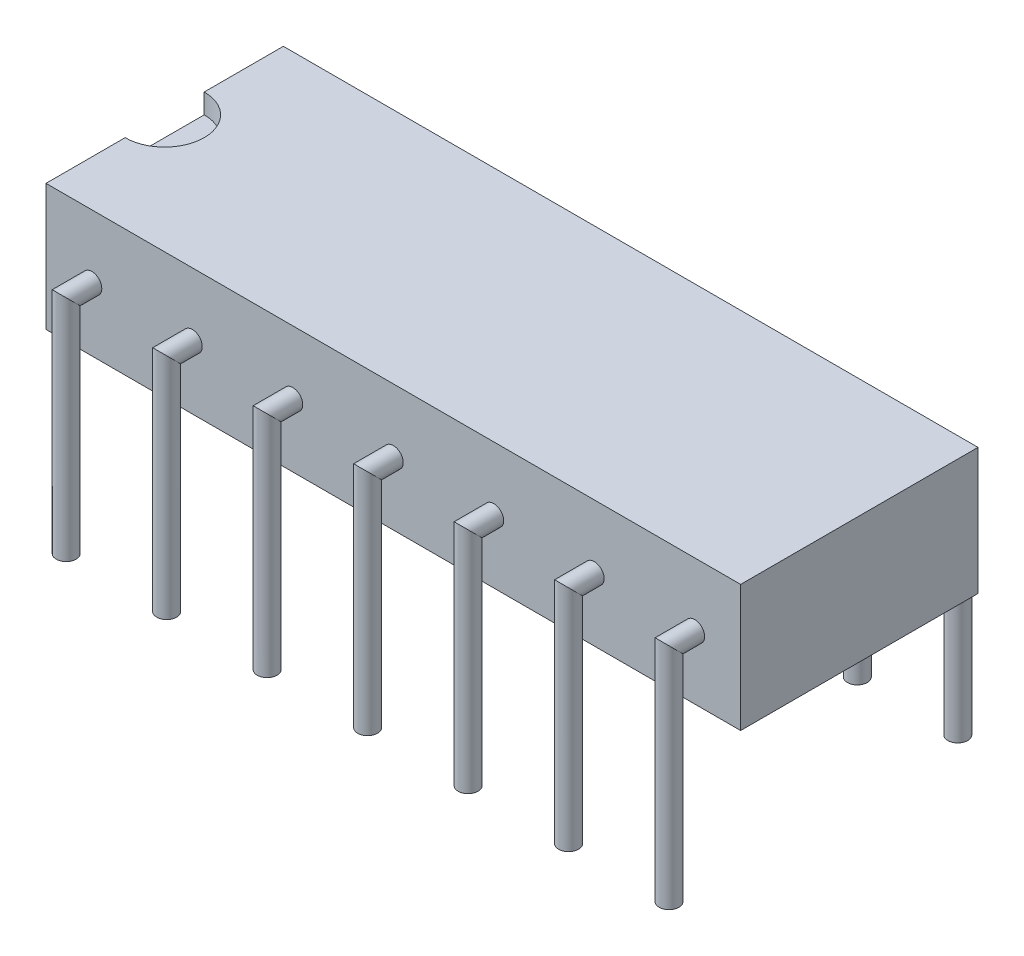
ISO-10303-21;
HEADER;
FILE_DESCRIPTION(('STEP AP214'),'2;1');
FILE_NAME('part.step','',(''),(''),'','','');
FILE_SCHEMA(('AUTOMOTIVE_DESIGN { 1 0 10303 214 1 1 1 1 }'));
ENDSEC;
DATA;
#1=APPLICATION_CONTEXT('core data for automotive mechanical design processes');
#2=APPLICATION_PROTOCOL_DEFINITION('international standard','automotive_design',2000,#1);
#3=PRODUCT_CONTEXT('',#1,'mechanical');
#4=PRODUCT('Part','Part','',(#3));
#5=PRODUCT_RELATED_PRODUCT_CATEGORY('part','',(#4));
#6=PRODUCT_DEFINITION_FORMATION('','',#4);
#7=PRODUCT_DEFINITION_CONTEXT('part definition',#1,'design');
#8=PRODUCT_DEFINITION('design','',#6,#7);
#9=PRODUCT_DEFINITION_SHAPE('','',#8);
#10=(LENGTH_UNIT() NAMED_UNIT(*) SI_UNIT(.MILLI.,.METRE.));
#11=(NAMED_UNIT(*) PLANE_ANGLE_UNIT() SI_UNIT($,.RADIAN.));
#12=(NAMED_UNIT(*) SI_UNIT($,.STERADIAN.) SOLID_ANGLE_UNIT());
#13=UNCERTAINTY_MEASURE_WITH_UNIT(LENGTH_MEASURE(1.E-05),#10,'distance_accuracy_value','');
#14=(GEOMETRIC_REPRESENTATION_CONTEXT(3) GLOBAL_UNCERTAINTY_ASSIGNED_CONTEXT((#13)) GLOBAL_UNIT_ASSIGNED_CONTEXT((#10,
#11,#12)) REPRESENTATION_CONTEXT('',''));
#15=CARTESIAN_POINT('',(0.,0.,0.));
#16=DIRECTION('',(0.,0.,1.));
#17=DIRECTION('',(1.,0.,0.));
#18=AXIS2_PLACEMENT_3D('',#15,#16,#17);
#19=CARTESIAN_POINT('',(17.56,3.2,3.));
#20=DIRECTION('',(0.,0.,-1.));
#21=DIRECTION('',(-1.,0.,0.));
#22=AXIS2_PLACEMENT_3D('',#19,#20,#21);
#23=PLANE('',#22);
#24=CARTESIAN_POINT('',(13.86,1.6,3.));
#25=DIRECTION('',(0.,0.,-1.));
#26=DIRECTION('',(-1.,0.,0.));
#27=AXIS2_PLACEMENT_3D('',#24,#25,#26);
#28=CIRCLE('',#27,0.25);
#29=CARTESIAN_POINT('',(13.61,1.6,3.));
#30=VERTEX_POINT('',#29);
#31=EDGE_CURVE('E55',#30,#30,#28,.F.);
#32=ORIENTED_EDGE('',*,*,#31,.F.);
#33=EDGE_LOOP('',(#32));
#34=FACE_BOUND('',#33,.T.);
#35=CARTESIAN_POINT('',(8.78,1.6,3.));
#36=DIRECTION('',(0.,0.,-1.));
#37=DIRECTION('',(-1.,0.,0.));
#38=AXIS2_PLACEMENT_3D('',#35,#36,#37);
#39=CIRCLE('',#38,0.25);
#40=CARTESIAN_POINT('',(8.53,1.6,3.));
#41=VERTEX_POINT('',#40);
#42=EDGE_CURVE('E155',#41,#41,#39,.F.);
#43=ORIENTED_EDGE('',*,*,#42,.F.);
#44=EDGE_LOOP('',(#43));
#45=FACE_BOUND('',#44,.T.);
#46=CARTESIAN_POINT('',(3.7,1.6,3.));
#47=DIRECTION('',(0.,0.,-1.));
#48=DIRECTION('',(-1.,0.,0.));
#49=AXIS2_PLACEMENT_3D('',#46,#47,#48);
#50=CIRCLE('',#49,0.25);
#51=CARTESIAN_POINT('',(3.45,1.6,3.));
#52=VERTEX_POINT('',#51);
#53=EDGE_CURVE('E149',#52,#52,#50,.F.);
#54=ORIENTED_EDGE('',*,*,#53,.F.);
#55=EDGE_LOOP('',(#54));
#56=FACE_BOUND('',#55,.T.);
#57=DIRECTION('',(0.,-1.,0.));
#58=VECTOR('',#57,1.);
#59=CARTESIAN_POINT('',(0.,3.2,3.));
#60=LINE('',#59,#58);
#61=CARTESIAN_POINT('',(0.,3.2,3.));
#62=VERTEX_POINT('',#61);
#63=CARTESIAN_POINT('',(0.,0.,3.));
#64=VERTEX_POINT('',#63);
#65=EDGE_CURVE('E177',#62,#64,#60,.T.);
#66=ORIENTED_EDGE('',*,*,#65,.T.);
#67=DIRECTION('',(-1.,0.,0.));
#68=VECTOR('',#67,1.);
#69=CARTESIAN_POINT('',(17.56,0.,3.));
#70=LINE('',#69,#68);
#71=CARTESIAN_POINT('',(17.56,0.,3.));
#72=VERTEX_POINT('',#71);
#73=EDGE_CURVE('E143',#72,#64,#70,.T.);
#74=ORIENTED_EDGE('',*,*,#73,.F.);
#75=DIRECTION('',(0.,-1.,0.));
#76=VECTOR('',#75,1.);
#77=CARTESIAN_POINT('',(17.56,3.2,3.));
#78=LINE('',#77,#76);
#79=CARTESIAN_POINT('',(17.56,3.2,3.));
#80=VERTEX_POINT('',#79);
#81=EDGE_CURVE('E123',#80,#72,#78,.T.);
#82=ORIENTED_EDGE('',*,*,#81,.F.);
#83=DIRECTION('',(-1.,0.,0.));
#84=VECTOR('',#83,1.);
#85=CARTESIAN_POINT('',(17.56,3.2,3.));
#86=LINE('',#85,#84);
#87=EDGE_CURVE('E136',#80,#62,#86,.T.);
#88=ORIENTED_EDGE('',*,*,#87,.T.);
#89=EDGE_LOOP('',(#66,#74,#82,#88));
#90=FACE_BOUND('',#89,.T.);
#91=CARTESIAN_POINT('',(1.16,1.6,3.));
#92=DIRECTION('',(0.,0.,-1.));
#93=DIRECTION('',(-1.,0.,0.));
#94=AXIS2_PLACEMENT_3D('',#91,#92,#93);
#95=CIRCLE('',#94,0.25);
#96=CARTESIAN_POINT('',(0.91,1.6,3.));
#97=VERTEX_POINT('',#96);
#98=EDGE_CURVE('E146',#97,#97,#95,.F.);
#99=ORIENTED_EDGE('',*,*,#98,.F.);
#100=EDGE_LOOP('',(#99));
#101=FACE_BOUND('',#100,.T.);
#102=CARTESIAN_POINT('',(6.24,1.6,3.));
#103=DIRECTION('',(0.,0.,-1.));
#104=DIRECTION('',(-1.,0.,0.));
#105=AXIS2_PLACEMENT_3D('',#102,#103,#104);
#106=CIRCLE('',#105,0.25);
#107=CARTESIAN_POINT('',(5.99,1.6,3.));
#108=VERTEX_POINT('',#107);
#109=EDGE_CURVE('E152',#108,#108,#106,.F.);
#110=ORIENTED_EDGE('',*,*,#109,.F.);
#111=EDGE_LOOP('',(#110));
#112=FACE_BOUND('',#111,.T.);
#113=CARTESIAN_POINT('',(11.32,1.6,3.));
#114=DIRECTION('',(0.,0.,-1.));
#115=DIRECTION('',(-1.,0.,0.));
#116=AXIS2_PLACEMENT_3D('',#113,#114,#115);
#117=CIRCLE('',#116,0.25);
#118=CARTESIAN_POINT('',(11.07,1.6,3.));
#119=VERTEX_POINT('',#118);
#120=EDGE_CURVE('E158',#119,#119,#117,.F.);
#121=ORIENTED_EDGE('',*,*,#120,.F.);
#122=EDGE_LOOP('',(#121));
#123=FACE_BOUND('',#122,.T.);
#124=CARTESIAN_POINT('',(16.4,1.6,3.));
#125=DIRECTION('',(0.,0.,-1.));
#126=DIRECTION('',(-1.,0.,0.));
#127=AXIS2_PLACEMENT_3D('',#124,#125,#126);
#128=CIRCLE('',#127,0.25);
#129=CARTESIAN_POINT('',(16.15,1.6,3.));
#130=VERTEX_POINT('',#129);
#131=EDGE_CURVE('E12',#130,#130,#128,.F.);
#132=ORIENTED_EDGE('',*,*,#131,.F.);
#133=EDGE_LOOP('',(#132));
#134=FACE_BOUND('',#133,.T.);
#135=ADVANCED_FACE('F48',(#34,#45,#56,#90,#101,#112,#123,#134),#23,.F.);
#136=CARTESIAN_POINT('',(17.56,0.,3.));
#137=DIRECTION('',(0.,1.,0.));
#138=DIRECTION('',(0.,0.,1.));
#139=AXIS2_PLACEMENT_3D('',#136,#137,#138);
#140=PLANE('',#139);
#141=DIRECTION('',(0.,0.,-1.));
#142=VECTOR('',#141,1.);
#143=CARTESIAN_POINT('',(0.,0.,3.));
#144=LINE('',#143,#142);
#145=CARTESIAN_POINT('',(0.,0.,-3.));
#146=VERTEX_POINT('',#145);
#147=EDGE_CURVE('E253',#64,#146,#144,.T.);
#148=ORIENTED_EDGE('',*,*,#147,.T.);
#149=DIRECTION('',(-1.,0.,0.));
#150=VECTOR('',#149,1.);
#151=CARTESIAN_POINT('',(17.56,0.,-3.));
#152=LINE('',#151,#150);
#153=CARTESIAN_POINT('',(17.56,0.,-3.));
#154=VERTEX_POINT('',#153);
#155=EDGE_CURVE('E140',#154,#146,#152,.T.);
#156=ORIENTED_EDGE('',*,*,#155,.F.);
#157=DIRECTION('',(0.,0.,-1.));
#158=VECTOR('',#157,1.);
#159=CARTESIAN_POINT('',(17.56,0.,3.));
#160=LINE('',#159,#158);
#161=EDGE_CURVE('E126',#72,#154,#160,.T.);
#162=ORIENTED_EDGE('',*,*,#161,.F.);
#163=ORIENTED_EDGE('',*,*,#73,.T.);
#164=EDGE_LOOP('',(#148,#156,#162,#163));
#165=FACE_BOUND('',#164,.T.);
#166=ADVANCED_FACE('F168',(#165),#140,.F.);
#167=CARTESIAN_POINT('',(17.56,3.2,-3.));
#168=DIRECTION('',(0.,0.,1.));
#169=DIRECTION('',(1.,0.,0.));
#170=AXIS2_PLACEMENT_3D('',#167,#168,#169);
#171=PLANE('',#170);
#172=CARTESIAN_POINT('',(16.4,1.6,-3.));
#173=DIRECTION('',(0.,0.,1.));
#174=DIRECTION('',(1.,0.,0.));
#175=AXIS2_PLACEMENT_3D('',#172,#173,#174);
#176=CIRCLE('',#175,0.25);
#177=CARTESIAN_POINT('',(16.65,1.6,-3.));
#178=VERTEX_POINT('',#177);
#179=EDGE_CURVE('E740',#178,#178,#176,.T.);
#180=ORIENTED_EDGE('',*,*,#179,.T.);
#181=EDGE_LOOP('',(#180));
#182=FACE_BOUND('',#181,.T.);
#183=CARTESIAN_POINT('',(13.86,1.6,-3.));
#184=DIRECTION('',(0.,0.,1.));
#185=DIRECTION('',(1.,0.,0.));
#186=AXIS2_PLACEMENT_3D('',#183,#184,#185);
#187=CIRCLE('',#186,0.25);
#188=CARTESIAN_POINT('',(14.11,1.6,-3.));
#189=VERTEX_POINT('',#188);
#190=EDGE_CURVE('E733',#189,#189,#187,.T.);
#191=ORIENTED_EDGE('',*,*,#190,.T.);
#192=EDGE_LOOP('',(#191));
#193=FACE_BOUND('',#192,.T.);
#194=CARTESIAN_POINT('',(11.32,1.6,-3.));
#195=DIRECTION('',(0.,0.,1.));
#196=DIRECTION('',(1.,0.,0.));
#197=AXIS2_PLACEMENT_3D('',#194,#195,#196);
#198=CIRCLE('',#197,0.25);
#199=CARTESIAN_POINT('',(11.57,1.6,-3.));
#200=VERTEX_POINT('',#199);
#201=EDGE_CURVE('E749',#200,#200,#198,.T.);
#202=ORIENTED_EDGE('',*,*,#201,.T.);
#203=EDGE_LOOP('',(#202));
#204=FACE_BOUND('',#203,.T.);
#205=CARTESIAN_POINT('',(8.78,1.6,-3.));
#206=DIRECTION('',(0.,0.,1.));
#207=DIRECTION('',(1.,0.,0.));
#208=AXIS2_PLACEMENT_3D('',#205,#206,#207);
#209=CIRCLE('',#208,0.25);
#210=CARTESIAN_POINT('',(9.03,1.6,-3.));
#211=VERTEX_POINT('',#210);
#212=EDGE_CURVE('E758',#211,#211,#209,.T.);
#213=ORIENTED_EDGE('',*,*,#212,.T.);
#214=EDGE_LOOP('',(#213));
#215=FACE_BOUND('',#214,.T.);
#216=CARTESIAN_POINT('',(6.24,1.6,-3.));
#217=DIRECTION('',(0.,0.,1.));
#218=DIRECTION('',(1.,0.,0.));
#219=AXIS2_PLACEMENT_3D('',#216,#217,#218);
#220=CIRCLE('',#219,0.25);
#221=CARTESIAN_POINT('',(6.49,1.6,-3.));
#222=VERTEX_POINT('',#221);
#223=EDGE_CURVE('E767',#222,#222,#220,.T.);
#224=ORIENTED_EDGE('',*,*,#223,.T.);
#225=EDGE_LOOP('',(#224));
#226=FACE_BOUND('',#225,.T.);
#227=CARTESIAN_POINT('',(3.7,1.6,-3.));
#228=DIRECTION('',(0.,0.,1.));
#229=DIRECTION('',(1.,0.,0.));
#230=AXIS2_PLACEMENT_3D('',#227,#228,#229);
#231=CIRCLE('',#230,0.25);
#232=CARTESIAN_POINT('',(3.95,1.6,-3.));
#233=VERTEX_POINT('',#232);
#234=EDGE_CURVE('E776',#233,#233,#231,.T.);
#235=ORIENTED_EDGE('',*,*,#234,.T.);
#236=EDGE_LOOP('',(#235));
#237=FACE_BOUND('',#236,.T.);
#238=CARTESIAN_POINT('',(1.16,1.6,-3.));
#239=DIRECTION('',(0.,0.,1.));
#240=DIRECTION('',(1.,0.,0.));
#241=AXIS2_PLACEMENT_3D('',#238,#239,#240);
#242=CIRCLE('',#241,0.25);
#243=CARTESIAN_POINT('',(1.41,1.6,-3.));
#244=VERTEX_POINT('',#243);
#245=EDGE_CURVE('E236',#244,#244,#242,.T.);
#246=ORIENTED_EDGE('',*,*,#245,.T.);
#247=EDGE_LOOP('',(#246));
#248=FACE_BOUND('',#247,.T.);
#249=DIRECTION('',(0.,1.,0.));
#250=VECTOR('',#249,1.);
#251=CARTESIAN_POINT('',(0.,3.2,-3.));
#252=LINE('',#251,#250);
#253=CARTESIAN_POINT('',(0.,3.2,-3.));
#254=VERTEX_POINT('',#253);
#255=EDGE_CURVE('E128',#146,#254,#252,.T.);
#256=ORIENTED_EDGE('',*,*,#255,.T.);
#257=DIRECTION('',(-1.,0.,0.));
#258=VECTOR('',#257,1.);
#259=CARTESIAN_POINT('',(17.56,3.2,-3.));
#260=LINE('',#259,#258);
#261=CARTESIAN_POINT('',(17.56,3.2,-3.));
#262=VERTEX_POINT('',#261);
#263=EDGE_CURVE('E122',#262,#254,#260,.T.);
#264=ORIENTED_EDGE('',*,*,#263,.F.);
#265=DIRECTION('',(0.,1.,0.));
#266=VECTOR('',#265,1.);
#267=CARTESIAN_POINT('',(17.56,3.2,-3.));
#268=LINE('',#267,#266);
#269=EDGE_CURVE('E133',#154,#262,#268,.T.);
#270=ORIENTED_EDGE('',*,*,#269,.F.);
#271=ORIENTED_EDGE('',*,*,#155,.T.);
#272=EDGE_LOOP('',(#256,#264,#270,#271));
#273=FACE_BOUND('',#272,.T.);
#274=ADVANCED_FACE('F257',(#182,#193,#204,#215,#226,#237,#248,#273),#171,.F.);
#275=CARTESIAN_POINT('',(17.56,3.2,3.));
#276=DIRECTION('',(0.,-1.,0.));
#277=DIRECTION('',(0.,0.,-1.));
#278=AXIS2_PLACEMENT_3D('',#275,#276,#277);
#279=PLANE('',#278);
#280=DIRECTION('',(0.,0.,1.));
#281=VECTOR('',#280,1.);
#282=CARTESIAN_POINT('',(0.,3.2,3.));
#283=LINE('',#282,#281);
#284=CARTESIAN_POINT('',(0.,3.2,-1.));
#285=VERTEX_POINT('',#284);
#286=EDGE_CURVE('E116',#254,#285,#283,.T.);
#287=ORIENTED_EDGE('',*,*,#286,.T.);
#288=CARTESIAN_POINT('',(0.,3.2,0.));
#289=DIRECTION('',(0.,1.,0.));
#290=DIRECTION('',(0.,0.,1.));
#291=AXIS2_PLACEMENT_3D('',#288,#289,#290);
#292=CIRCLE('',#291,1.);
#293=CARTESIAN_POINT('',(0.,3.2,1.));
#294=VERTEX_POINT('',#293);
#295=EDGE_CURVE('E100',#294,#285,#292,.T.);
#296=ORIENTED_EDGE('',*,*,#295,.F.);
#297=EDGE_CURVE('E124',#294,#62,#283,.T.);
#298=ORIENTED_EDGE('',*,*,#297,.T.);
#299=ORIENTED_EDGE('',*,*,#87,.F.);
#300=DIRECTION('',(0.,0.,1.));
#301=VECTOR('',#300,1.);
#302=CARTESIAN_POINT('',(17.56,3.2,3.));
#303=LINE('',#302,#301);
#304=EDGE_CURVE('E69',#262,#80,#303,.T.);
#305=ORIENTED_EDGE('',*,*,#304,.F.);
#306=ORIENTED_EDGE('',*,*,#263,.T.);
#307=EDGE_LOOP('',(#287,#296,#298,#299,#305,#306));
#308=FACE_BOUND('',#307,.T.);
#309=ADVANCED_FACE('F120',(#308),#279,.F.);
#310=CARTESIAN_POINT('',(17.56,0.,3.));
#311=DIRECTION('',(1.,0.,0.));
#312=DIRECTION('',(0.,0.,-1.));
#313=AXIS2_PLACEMENT_3D('',#310,#311,#312);
#314=PLANE('',#313);
#315=ORIENTED_EDGE('',*,*,#81,.T.);
#316=ORIENTED_EDGE('',*,*,#161,.T.);
#317=ORIENTED_EDGE('',*,*,#269,.T.);
#318=ORIENTED_EDGE('',*,*,#304,.T.);
#319=EDGE_LOOP('',(#315,#316,#317,#318));
#320=FACE_BOUND('',#319,.T.);
#321=ADVANCED_FACE('F260',(#320),#314,.T.);
#322=CARTESIAN_POINT('',(0.,0.,3.));
#323=DIRECTION('',(1.,0.,0.));
#324=DIRECTION('',(0.,0.,-1.));
#325=AXIS2_PLACEMENT_3D('',#322,#323,#324);
#326=PLANE('',#325);
#327=DIRECTION('',(0.,0.,1.));
#328=VECTOR('',#327,1.);
#329=CARTESIAN_POINT('',(0.,2.7,-1.));
#330=LINE('',#329,#328);
#331=CARTESIAN_POINT('',(0.,2.7,-1.));
#332=VERTEX_POINT('',#331);
#333=CARTESIAN_POINT('',(0.,2.7,1.));
#334=VERTEX_POINT('',#333);
#335=EDGE_CURVE('E117',#332,#334,#330,.T.);
#336=ORIENTED_EDGE('',*,*,#335,.F.);
#337=DIRECTION('',(0.,1.,0.));
#338=VECTOR('',#337,1.);
#339=CARTESIAN_POINT('',(0.,2.7,-1.));
#340=LINE('',#339,#338);
#341=EDGE_CURVE('E103',#332,#285,#340,.T.);
#342=ORIENTED_EDGE('',*,*,#341,.T.);
#343=ORIENTED_EDGE('',*,*,#286,.F.);
#344=ORIENTED_EDGE('',*,*,#255,.F.);
#345=ORIENTED_EDGE('',*,*,#147,.F.);
#346=ORIENTED_EDGE('',*,*,#65,.F.);
#347=ORIENTED_EDGE('',*,*,#297,.F.);
#348=DIRECTION('',(0.,1.,0.));
#349=VECTOR('',#348,1.);
#350=CARTESIAN_POINT('',(0.,2.7,1.));
#351=LINE('',#350,#349);
#352=EDGE_CURVE('E106',#334,#294,#351,.T.);
#353=ORIENTED_EDGE('',*,*,#352,.F.);
#354=EDGE_LOOP('',(#336,#342,#343,#344,#345,#346,#347,#353));
#355=FACE_BOUND('',#354,.T.);
#356=ADVANCED_FACE('F114',(#355),#326,.F.);
#357=CARTESIAN_POINT('',(0.,2.7,0.));
#358=DIRECTION('',(0.,1.,0.));
#359=DIRECTION('',(0.,0.,1.));
#360=AXIS2_PLACEMENT_3D('',#357,#358,#359);
#361=CYLINDRICAL_SURFACE('',#360,1.);
#362=ORIENTED_EDGE('',*,*,#295,.T.);
#363=ORIENTED_EDGE('',*,*,#341,.F.);
#364=CARTESIAN_POINT('',(0.,2.7,0.));
#365=DIRECTION('',(0.,1.,0.));
#366=DIRECTION('',(0.,0.,1.));
#367=AXIS2_PLACEMENT_3D('',#364,#365,#366);
#368=CIRCLE('',#367,1.);
#369=EDGE_CURVE('E61',#334,#332,#368,.T.);
#370=ORIENTED_EDGE('',*,*,#369,.F.);
#371=ORIENTED_EDGE('',*,*,#352,.T.);
#372=EDGE_LOOP('',(#362,#363,#370,#371));
#373=FACE_BOUND('',#372,.T.);
#374=ADVANCED_FACE('F102',(#373),#361,.F.);
#375=CARTESIAN_POINT('',(0.,2.7,0.));
#376=DIRECTION('',(0.,1.,0.));
#377=DIRECTION('',(0.,0.,1.));
#378=AXIS2_PLACEMENT_3D('',#375,#376,#377);
#379=PLANE('',#378);
#380=ORIENTED_EDGE('',*,*,#369,.T.);
#381=ORIENTED_EDGE('',*,*,#335,.T.);
#382=EDGE_LOOP('',(#380,#381));
#383=FACE_BOUND('',#382,.T.);
#384=ADVANCED_FACE('F304',(#383),#379,.T.);
#385=CARTESIAN_POINT('',(1.16,1.6,3.65));
#386=DIRECTION('',(0.,-1.,0.));
#387=DIRECTION('',(0.,0.,-1.));
#388=AXIS2_PLACEMENT_3D('',#385,#386,#387);
#389=CYLINDRICAL_SURFACE('',#388,0.25);
#390=CARTESIAN_POINT('',(1.16,1.6,3.65));
#391=DIRECTION('',(0.,-0.707106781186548,0.707106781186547));
#392=DIRECTION('',(0.,-0.707106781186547,-0.707106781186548));
#393=AXIS2_PLACEMENT_3D('',#390,#391,#392);
#394=ELLIPSE('',#393,0.353553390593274,0.25);
#395=CARTESIAN_POINT('',(1.16,1.35,3.4));
#396=VERTEX_POINT('',#395);
#397=EDGE_CURVE('E245',#396,#396,#394,.T.);
#398=ORIENTED_EDGE('',*,*,#397,.T.);
#399=EDGE_LOOP('',(#398));
#400=FACE_BOUND('',#399,.T.);
#401=CARTESIAN_POINT('',(1.16,-4.,3.65));
#402=DIRECTION('',(0.,-1.,0.));
#403=DIRECTION('',(0.,0.,-1.));
#404=AXIS2_PLACEMENT_3D('',#401,#402,#403);
#405=CIRCLE('',#404,0.25);
#406=CARTESIAN_POINT('',(1.16,-4.,3.4));
#407=VERTEX_POINT('',#406);
#408=EDGE_CURVE('E110',#407,#407,#405,.F.);
#409=ORIENTED_EDGE('',*,*,#408,.T.);
#410=EDGE_LOOP('',(#409));
#411=FACE_BOUND('',#410,.T.);
#412=ADVANCED_FACE('F312',(#400,#411),#389,.T.);
#413=CARTESIAN_POINT('',(1.16,1.6,4.35710678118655));
#414=DIRECTION('',(0.,0.,-1.));
#415=DIRECTION('',(0.,1.,0.));
#416=AXIS2_PLACEMENT_3D('',#413,#414,#415);
#417=CYLINDRICAL_SURFACE('',#416,0.25);
#418=ORIENTED_EDGE('',*,*,#98,.T.);
#419=EDGE_LOOP('',(#418));
#420=FACE_BOUND('',#419,.T.);
#421=ORIENTED_EDGE('',*,*,#397,.F.);
#422=EDGE_LOOP('',(#421));
#423=FACE_BOUND('',#422,.T.);
#424=ADVANCED_FACE('F321',(#420,#423),#417,.T.);
#425=CARTESIAN_POINT('',(1.16,-4.,3.65));
#426=DIRECTION('',(0.,-1.,0.));
#427=DIRECTION('',(0.,0.,-1.));
#428=AXIS2_PLACEMENT_3D('',#425,#426,#427);
#429=PLANE('',#428);
#430=ORIENTED_EDGE('',*,*,#408,.F.);
#431=EDGE_LOOP('',(#430));
#432=FACE_BOUND('',#431,.T.);
#433=ADVANCED_FACE('F331',(#432),#429,.T.);
#434=CARTESIAN_POINT('',(1.16,1.6,-3.65));
#435=DIRECTION('',(0.,-1.,0.));
#436=DIRECTION('',(0.,0.,-1.));
#437=AXIS2_PLACEMENT_3D('',#434,#435,#436);
#438=CYLINDRICAL_SURFACE('',#437,0.25);
#439=CARTESIAN_POINT('',(1.16,1.6,-3.65));
#440=DIRECTION('',(0.,-0.707106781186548,-0.707106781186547));
#441=DIRECTION('',(0.,-0.707106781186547,0.707106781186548));
#442=AXIS2_PLACEMENT_3D('',#439,#440,#441);
#443=ELLIPSE('',#442,0.353553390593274,0.25);
#444=CARTESIAN_POINT('',(1.16,1.35,-3.4));
#445=VERTEX_POINT('',#444);
#446=EDGE_CURVE('E239',#445,#445,#443,.F.);
#447=ORIENTED_EDGE('',*,*,#446,.F.);
#448=EDGE_LOOP('',(#447));
#449=FACE_BOUND('',#448,.T.);
#450=CARTESIAN_POINT('',(1.16,-4.,-3.65));
#451=DIRECTION('',(0.,-1.,0.));
#452=DIRECTION('',(0.,0.,-1.));
#453=AXIS2_PLACEMENT_3D('',#450,#451,#452);
#454=CIRCLE('',#453,0.25);
#455=CARTESIAN_POINT('',(1.16,-4.,-3.9));
#456=VERTEX_POINT('',#455);
#457=EDGE_CURVE('E242',#456,#456,#454,.T.);
#458=ORIENTED_EDGE('',*,*,#457,.F.);
#459=EDGE_LOOP('',(#458));
#460=FACE_BOUND('',#459,.T.);
#461=ADVANCED_FACE('F341',(#449,#460),#438,.T.);
#462=CARTESIAN_POINT('',(1.16,1.6,-4.35710678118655));
#463=DIRECTION('',(0.,0.,1.));
#464=DIRECTION('',(0.,-1.,0.));
#465=AXIS2_PLACEMENT_3D('',#462,#463,#464);
#466=CYLINDRICAL_SURFACE('',#465,0.25);
#467=ORIENTED_EDGE('',*,*,#245,.F.);
#468=EDGE_LOOP('',(#467));
#469=FACE_BOUND('',#468,.T.);
#470=ORIENTED_EDGE('',*,*,#446,.T.);
#471=EDGE_LOOP('',(#470));
#472=FACE_BOUND('',#471,.T.);
#473=ADVANCED_FACE('F351',(#469,#472),#466,.T.);
#474=CARTESIAN_POINT('',(1.16,-4.,-3.65));
#475=DIRECTION('',(0.,-1.,0.));
#476=DIRECTION('',(0.,0.,-1.));
#477=AXIS2_PLACEMENT_3D('',#474,#475,#476);
#478=PLANE('',#477);
#479=ORIENTED_EDGE('',*,*,#457,.T.);
#480=EDGE_LOOP('',(#479));
#481=FACE_BOUND('',#480,.T.);
#482=ADVANCED_FACE('F361',(#481),#478,.T.);
#483=CARTESIAN_POINT('',(3.7,1.6,3.65));
#484=DIRECTION('',(0.,-1.,0.));
#485=DIRECTION('',(0.,0.,-1.));
#486=AXIS2_PLACEMENT_3D('',#483,#484,#485);
#487=CYLINDRICAL_SURFACE('',#486,0.25);
#488=CARTESIAN_POINT('',(3.7,1.6,3.65));
#489=DIRECTION('',(0.,-0.707106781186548,0.707106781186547));
#490=DIRECTION('',(0.,-0.707106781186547,-0.707106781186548));
#491=AXIS2_PLACEMENT_3D('',#488,#489,#490);
#492=ELLIPSE('',#491,0.353553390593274,0.25);
#493=CARTESIAN_POINT('',(3.7,1.35,3.4));
#494=VERTEX_POINT('',#493);
#495=EDGE_CURVE('E230',#494,#494,#492,.T.);
#496=ORIENTED_EDGE('',*,*,#495,.T.);
#497=EDGE_LOOP('',(#496));
#498=FACE_BOUND('',#497,.T.);
#499=CARTESIAN_POINT('',(3.7,-4.,3.65));
#500=DIRECTION('',(0.,-1.,0.));
#501=DIRECTION('',(0.,0.,-1.));
#502=AXIS2_PLACEMENT_3D('',#499,#500,#501);
#503=CIRCLE('',#502,0.25);
#504=CARTESIAN_POINT('',(3.7,-4.,3.4));
#505=VERTEX_POINT('',#504);
#506=EDGE_CURVE('E233',#505,#505,#503,.F.);
#507=ORIENTED_EDGE('',*,*,#506,.T.);
#508=EDGE_LOOP('',(#507));
#509=FACE_BOUND('',#508,.T.);
#510=ADVANCED_FACE('F370',(#498,#509),#487,.T.);
#511=CARTESIAN_POINT('',(3.7,1.6,4.35710678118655));
#512=DIRECTION('',(0.,0.,-1.));
#513=DIRECTION('',(0.,1.,0.));
#514=AXIS2_PLACEMENT_3D('',#511,#512,#513);
#515=CYLINDRICAL_SURFACE('',#514,0.25);
#516=ORIENTED_EDGE('',*,*,#53,.T.);
#517=EDGE_LOOP('',(#516));
#518=FACE_BOUND('',#517,.T.);
#519=ORIENTED_EDGE('',*,*,#495,.F.);
#520=EDGE_LOOP('',(#519));
#521=FACE_BOUND('',#520,.T.);
#522=ADVANCED_FACE('F385',(#518,#521),#515,.T.);
#523=CARTESIAN_POINT('',(3.7,-4.,3.65));
#524=DIRECTION('',(0.,-1.,0.));
#525=DIRECTION('',(0.,0.,-1.));
#526=AXIS2_PLACEMENT_3D('',#523,#524,#525);
#527=PLANE('',#526);
#528=ORIENTED_EDGE('',*,*,#506,.F.);
#529=EDGE_LOOP('',(#528));
#530=FACE_BOUND('',#529,.T.);
#531=ADVANCED_FACE('F394',(#530),#527,.T.);
#532=CARTESIAN_POINT('',(6.24,1.6,3.65));
#533=DIRECTION('',(0.,-1.,0.));
#534=DIRECTION('',(0.,0.,-1.));
#535=AXIS2_PLACEMENT_3D('',#532,#533,#534);
#536=CYLINDRICAL_SURFACE('',#535,0.25);
#537=CARTESIAN_POINT('',(6.24,1.6,3.65));
#538=DIRECTION('',(0.,-0.707106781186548,0.707106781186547));
#539=DIRECTION('',(0.,-0.707106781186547,-0.707106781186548));
#540=AXIS2_PLACEMENT_3D('',#537,#538,#539);
#541=ELLIPSE('',#540,0.353553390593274,0.25);
#542=CARTESIAN_POINT('',(6.24,1.35,3.4));
#543=VERTEX_POINT('',#542);
#544=EDGE_CURVE('E224',#543,#543,#541,.T.);
#545=ORIENTED_EDGE('',*,*,#544,.T.);
#546=EDGE_LOOP('',(#545));
#547=FACE_BOUND('',#546,.T.);
#548=CARTESIAN_POINT('',(6.24,-4.,3.65));
#549=DIRECTION('',(0.,-1.,0.));
#550=DIRECTION('',(0.,0.,-1.));
#551=AXIS2_PLACEMENT_3D('',#548,#549,#550);
#552=CIRCLE('',#551,0.25);
#553=CARTESIAN_POINT('',(6.24,-4.,3.4));
#554=VERTEX_POINT('',#553);
#555=EDGE_CURVE('E227',#554,#554,#552,.F.);
#556=ORIENTED_EDGE('',*,*,#555,.T.);
#557=EDGE_LOOP('',(#556));
#558=FACE_BOUND('',#557,.T.);
#559=ADVANCED_FACE('F403',(#547,#558),#536,.T.);
#560=CARTESIAN_POINT('',(6.24,1.6,4.35710678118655));
#561=DIRECTION('',(0.,0.,-1.));
#562=DIRECTION('',(0.,1.,0.));
#563=AXIS2_PLACEMENT_3D('',#560,#561,#562);
#564=CYLINDRICAL_SURFACE('',#563,0.25);
#565=ORIENTED_EDGE('',*,*,#109,.T.);
#566=EDGE_LOOP('',(#565));
#567=FACE_BOUND('',#566,.T.);
#568=ORIENTED_EDGE('',*,*,#544,.F.);
#569=EDGE_LOOP('',(#568));
#570=FACE_BOUND('',#569,.T.);
#571=ADVANCED_FACE('F412',(#567,#570),#564,.T.);
#572=CARTESIAN_POINT('',(6.24,-4.,3.65));
#573=DIRECTION('',(0.,-1.,0.));
#574=DIRECTION('',(0.,0.,-1.));
#575=AXIS2_PLACEMENT_3D('',#572,#573,#574);
#576=PLANE('',#575);
#577=ORIENTED_EDGE('',*,*,#555,.F.);
#578=EDGE_LOOP('',(#577));
#579=FACE_BOUND('',#578,.T.);
#580=ADVANCED_FACE('F421',(#579),#576,.T.);
#581=CARTESIAN_POINT('',(8.78,1.6,3.65));
#582=DIRECTION('',(0.,-1.,0.));
#583=DIRECTION('',(0.,0.,-1.));
#584=AXIS2_PLACEMENT_3D('',#581,#582,#583);
#585=CYLINDRICAL_SURFACE('',#584,0.25);
#586=CARTESIAN_POINT('',(8.78,1.6,3.65));
#587=DIRECTION('',(0.,-0.707106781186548,0.707106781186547));
#588=DIRECTION('',(0.,-0.707106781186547,-0.707106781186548));
#589=AXIS2_PLACEMENT_3D('',#586,#587,#588);
#590=ELLIPSE('',#589,0.353553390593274,0.25);
#591=CARTESIAN_POINT('',(8.78,1.35,3.4));
#592=VERTEX_POINT('',#591);
#593=EDGE_CURVE('E218',#592,#592,#590,.T.);
#594=ORIENTED_EDGE('',*,*,#593,.T.);
#595=EDGE_LOOP('',(#594));
#596=FACE_BOUND('',#595,.T.);
#597=CARTESIAN_POINT('',(8.78,-4.,3.65));
#598=DIRECTION('',(0.,-1.,0.));
#599=DIRECTION('',(0.,0.,-1.));
#600=AXIS2_PLACEMENT_3D('',#597,#598,#599);
#601=CIRCLE('',#600,0.25);
#602=CARTESIAN_POINT('',(8.78,-4.,3.4));
#603=VERTEX_POINT('',#602);
#604=EDGE_CURVE('E221',#603,#603,#601,.F.);
#605=ORIENTED_EDGE('',*,*,#604,.T.);
#606=EDGE_LOOP('',(#605));
#607=FACE_BOUND('',#606,.T.);
#608=ADVANCED_FACE('F430',(#596,#607),#585,.T.);
#609=CARTESIAN_POINT('',(8.78,1.6,4.35710678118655));
#610=DIRECTION('',(0.,0.,-1.));
#611=DIRECTION('',(0.,1.,0.));
#612=AXIS2_PLACEMENT_3D('',#609,#610,#611);
#613=CYLINDRICAL_SURFACE('',#612,0.25);
#614=ORIENTED_EDGE('',*,*,#42,.T.);
#615=EDGE_LOOP('',(#614));
#616=FACE_BOUND('',#615,.T.);
#617=ORIENTED_EDGE('',*,*,#593,.F.);
#618=EDGE_LOOP('',(#617));
#619=FACE_BOUND('',#618,.T.);
#620=ADVANCED_FACE('F439',(#616,#619),#613,.T.);
#621=CARTESIAN_POINT('',(8.78,-4.,3.65));
#622=DIRECTION('',(0.,-1.,0.));
#623=DIRECTION('',(0.,0.,-1.));
#624=AXIS2_PLACEMENT_3D('',#621,#622,#623);
#625=PLANE('',#624);
#626=ORIENTED_EDGE('',*,*,#604,.F.);
#627=EDGE_LOOP('',(#626));
#628=FACE_BOUND('',#627,.T.);
#629=ADVANCED_FACE('F448',(#628),#625,.T.);
#630=CARTESIAN_POINT('',(11.32,1.6,3.65));
#631=DIRECTION('',(0.,-1.,0.));
#632=DIRECTION('',(0.,0.,-1.));
#633=AXIS2_PLACEMENT_3D('',#630,#631,#632);
#634=CYLINDRICAL_SURFACE('',#633,0.25);
#635=CARTESIAN_POINT('',(11.32,1.6,3.65));
#636=DIRECTION('',(0.,-0.707106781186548,0.707106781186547));
#637=DIRECTION('',(0.,-0.707106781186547,-0.707106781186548));
#638=AXIS2_PLACEMENT_3D('',#635,#636,#637);
#639=ELLIPSE('',#638,0.353553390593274,0.25);
#640=CARTESIAN_POINT('',(11.32,1.35,3.4));
#641=VERTEX_POINT('',#640);
#642=EDGE_CURVE('E212',#641,#641,#639,.T.);
#643=ORIENTED_EDGE('',*,*,#642,.T.);
#644=EDGE_LOOP('',(#643));
#645=FACE_BOUND('',#644,.T.);
#646=CARTESIAN_POINT('',(11.32,-4.,3.65));
#647=DIRECTION('',(0.,-1.,0.));
#648=DIRECTION('',(0.,0.,-1.));
#649=AXIS2_PLACEMENT_3D('',#646,#647,#648);
#650=CIRCLE('',#649,0.25);
#651=CARTESIAN_POINT('',(11.32,-4.,3.4));
#652=VERTEX_POINT('',#651);
#653=EDGE_CURVE('E215',#652,#652,#650,.F.);
#654=ORIENTED_EDGE('',*,*,#653,.T.);
#655=EDGE_LOOP('',(#654));
#656=FACE_BOUND('',#655,.T.);
#657=ADVANCED_FACE('F457',(#645,#656),#634,.T.);
#658=CARTESIAN_POINT('',(11.32,1.6,4.35710678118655));
#659=DIRECTION('',(0.,0.,-1.));
#660=DIRECTION('',(0.,1.,0.));
#661=AXIS2_PLACEMENT_3D('',#658,#659,#660);
#662=CYLINDRICAL_SURFACE('',#661,0.25);
#663=ORIENTED_EDGE('',*,*,#120,.T.);
#664=EDGE_LOOP('',(#663));
#665=FACE_BOUND('',#664,.T.);
#666=ORIENTED_EDGE('',*,*,#642,.F.);
#667=EDGE_LOOP('',(#666));
#668=FACE_BOUND('',#667,.T.);
#669=ADVANCED_FACE('F466',(#665,#668),#662,.T.);
#670=CARTESIAN_POINT('',(11.32,-4.,3.65));
#671=DIRECTION('',(0.,-1.,0.));
#672=DIRECTION('',(0.,0.,-1.));
#673=AXIS2_PLACEMENT_3D('',#670,#671,#672);
#674=PLANE('',#673);
#675=ORIENTED_EDGE('',*,*,#653,.F.);
#676=EDGE_LOOP('',(#675));
#677=FACE_BOUND('',#676,.T.);
#678=ADVANCED_FACE('F475',(#677),#674,.T.);
#679=CARTESIAN_POINT('',(13.86,1.6,3.65));
#680=DIRECTION('',(0.,-1.,0.));
#681=DIRECTION('',(0.,0.,-1.));
#682=AXIS2_PLACEMENT_3D('',#679,#680,#681);
#683=CYLINDRICAL_SURFACE('',#682,0.25);
#684=CARTESIAN_POINT('',(13.86,1.6,3.65));
#685=DIRECTION('',(0.,-0.707106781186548,0.707106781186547));
#686=DIRECTION('',(0.,-0.707106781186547,-0.707106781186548));
#687=AXIS2_PLACEMENT_3D('',#684,#685,#686);
#688=ELLIPSE('',#687,0.353553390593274,0.25);
#689=CARTESIAN_POINT('',(13.86,1.35,3.4));
#690=VERTEX_POINT('',#689);
#691=EDGE_CURVE('E200',#690,#690,#688,.T.);
#692=ORIENTED_EDGE('',*,*,#691,.T.);
#693=EDGE_LOOP('',(#692));
#694=FACE_BOUND('',#693,.T.);
#695=CARTESIAN_POINT('',(13.86,-4.,3.65));
#696=DIRECTION('',(0.,-1.,0.));
#697=DIRECTION('',(0.,0.,-1.));
#698=AXIS2_PLACEMENT_3D('',#695,#696,#697);
#699=CIRCLE('',#698,0.25);
#700=CARTESIAN_POINT('',(13.86,-4.,3.4));
#701=VERTEX_POINT('',#700);
#702=EDGE_CURVE('E209',#701,#701,#699,.F.);
#703=ORIENTED_EDGE('',*,*,#702,.T.);
#704=EDGE_LOOP('',(#703));
#705=FACE_BOUND('',#704,.T.);
#706=ADVANCED_FACE('F484',(#694,#705),#683,.T.);
#707=CARTESIAN_POINT('',(13.86,1.6,4.35710678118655));
#708=DIRECTION('',(0.,0.,-1.));
#709=DIRECTION('',(0.,1.,0.));
#710=AXIS2_PLACEMENT_3D('',#707,#708,#709);
#711=CYLINDRICAL_SURFACE('',#710,0.25);
#712=ORIENTED_EDGE('',*,*,#31,.T.);
#713=EDGE_LOOP('',(#712));
#714=FACE_BOUND('',#713,.T.);
#715=ORIENTED_EDGE('',*,*,#691,.F.);
#716=EDGE_LOOP('',(#715));
#717=FACE_BOUND('',#716,.T.);
#718=ADVANCED_FACE('F163',(#714,#717),#711,.T.);
#719=CARTESIAN_POINT('',(13.86,-4.,3.65));
#720=DIRECTION('',(0.,-1.,0.));
#721=DIRECTION('',(0.,0.,-1.));
#722=AXIS2_PLACEMENT_3D('',#719,#720,#721);
#723=PLANE('',#722);
#724=ORIENTED_EDGE('',*,*,#702,.F.);
#725=EDGE_LOOP('',(#724));
#726=FACE_BOUND('',#725,.T.);
#727=ADVANCED_FACE('F501',(#726),#723,.T.);
#728=CARTESIAN_POINT('',(16.4,1.6,3.65));
#729=DIRECTION('',(0.,-1.,0.));
#730=DIRECTION('',(0.,0.,-1.));
#731=AXIS2_PLACEMENT_3D('',#728,#729,#730);
#732=CYLINDRICAL_SURFACE('',#731,0.25);
#733=CARTESIAN_POINT('',(16.4,1.6,3.65));
#734=DIRECTION('',(0.,-0.707106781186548,0.707106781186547));
#735=DIRECTION('',(0.,-0.707106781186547,-0.707106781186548));
#736=AXIS2_PLACEMENT_3D('',#733,#734,#735);
#737=ELLIPSE('',#736,0.353553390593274,0.25);
#738=CARTESIAN_POINT('',(16.4,1.35,3.4));
#739=VERTEX_POINT('',#738);
#740=EDGE_CURVE('E194',#739,#739,#737,.T.);
#741=ORIENTED_EDGE('',*,*,#740,.T.);
#742=EDGE_LOOP('',(#741));
#743=FACE_BOUND('',#742,.T.);
#744=CARTESIAN_POINT('',(16.4,-4.,3.65));
#745=DIRECTION('',(0.,-1.,0.));
#746=DIRECTION('',(0.,0.,-1.));
#747=AXIS2_PLACEMENT_3D('',#744,#745,#746);
#748=CIRCLE('',#747,0.25);
#749=CARTESIAN_POINT('',(16.4,-4.,3.4));
#750=VERTEX_POINT('',#749);
#751=EDGE_CURVE('E196',#750,#750,#748,.F.);
#752=ORIENTED_EDGE('',*,*,#751,.T.);
#753=EDGE_LOOP('',(#752));
#754=FACE_BOUND('',#753,.T.);
#755=ADVANCED_FACE('F190',(#743,#754),#732,.T.);
#756=CARTESIAN_POINT('',(16.4,1.6,4.35710678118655));
#757=DIRECTION('',(0.,0.,-1.));
#758=DIRECTION('',(0.,1.,0.));
#759=AXIS2_PLACEMENT_3D('',#756,#757,#758);
#760=CYLINDRICAL_SURFACE('',#759,0.25);
#761=ORIENTED_EDGE('',*,*,#131,.T.);
#762=EDGE_LOOP('',(#761));
#763=FACE_BOUND('',#762,.T.);
#764=ORIENTED_EDGE('',*,*,#740,.F.);
#765=EDGE_LOOP('',(#764));
#766=FACE_BOUND('',#765,.T.);
#767=ADVANCED_FACE('F186',(#763,#766),#760,.T.);
#768=CARTESIAN_POINT('',(16.4,-4.,3.65));
#769=DIRECTION('',(0.,-1.,0.));
#770=DIRECTION('',(0.,0.,-1.));
#771=AXIS2_PLACEMENT_3D('',#768,#769,#770);
#772=PLANE('',#771);
#773=ORIENTED_EDGE('',*,*,#751,.F.);
#774=EDGE_LOOP('',(#773));
#775=FACE_BOUND('',#774,.T.);
#776=ADVANCED_FACE('F189',(#775),#772,.T.);
#777=CARTESIAN_POINT('',(3.7,1.6,-3.65));
#778=DIRECTION('',(0.,-1.,0.));
#779=DIRECTION('',(0.,0.,-1.));
#780=AXIS2_PLACEMENT_3D('',#777,#778,#779);
#781=CYLINDRICAL_SURFACE('',#780,0.25);
#782=CARTESIAN_POINT('',(3.7,1.6,-3.65));
#783=DIRECTION('',(0.,-0.707106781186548,-0.707106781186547));
#784=DIRECTION('',(0.,-0.707106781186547,0.707106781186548));
#785=AXIS2_PLACEMENT_3D('',#782,#783,#784);
#786=ELLIPSE('',#785,0.353553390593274,0.25);
#787=CARTESIAN_POINT('',(3.7,1.35,-3.4));
#788=VERTEX_POINT('',#787);
#789=EDGE_CURVE('E203',#788,#788,#786,.F.);
#790=ORIENTED_EDGE('',*,*,#789,.F.);
#791=EDGE_LOOP('',(#790));
#792=FACE_BOUND('',#791,.T.);
#793=CARTESIAN_POINT('',(3.7,-4.,-3.65));
#794=DIRECTION('',(0.,-1.,0.));
#795=DIRECTION('',(0.,0.,-1.));
#796=AXIS2_PLACEMENT_3D('',#793,#794,#795);
#797=CIRCLE('',#796,0.25);
#798=CARTESIAN_POINT('',(3.7,-4.,-3.9));
#799=VERTEX_POINT('',#798);
#800=EDGE_CURVE('E197',#799,#799,#797,.T.);
#801=ORIENTED_EDGE('',*,*,#800,.F.);
#802=EDGE_LOOP('',(#801));
#803=FACE_BOUND('',#802,.T.);
#804=ADVANCED_FACE('F529',(#792,#803),#781,.T.);
#805=CARTESIAN_POINT('',(3.7,1.6,-4.35710678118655));
#806=DIRECTION('',(0.,0.,1.));
#807=DIRECTION('',(0.,-1.,0.));
#808=AXIS2_PLACEMENT_3D('',#805,#806,#807);
#809=CYLINDRICAL_SURFACE('',#808,0.25);
#810=ORIENTED_EDGE('',*,*,#234,.F.);
#811=EDGE_LOOP('',(#810));
#812=FACE_BOUND('',#811,.T.);
#813=ORIENTED_EDGE('',*,*,#789,.T.);
#814=EDGE_LOOP('',(#813));
#815=FACE_BOUND('',#814,.T.);
#816=ADVANCED_FACE('F538',(#812,#815),#809,.T.);
#817=CARTESIAN_POINT('',(3.7,-4.,-3.65));
#818=DIRECTION('',(0.,-1.,0.));
#819=DIRECTION('',(0.,0.,-1.));
#820=AXIS2_PLACEMENT_3D('',#817,#818,#819);
#821=PLANE('',#820);
#822=ORIENTED_EDGE('',*,*,#800,.T.);
#823=EDGE_LOOP('',(#822));
#824=FACE_BOUND('',#823,.T.);
#825=ADVANCED_FACE('F547',(#824),#821,.T.);
#826=CARTESIAN_POINT('',(6.24,1.6,-3.65));
#827=DIRECTION('',(0.,-1.,0.));
#828=DIRECTION('',(0.,0.,-1.));
#829=AXIS2_PLACEMENT_3D('',#826,#827,#828);
#830=CYLINDRICAL_SURFACE('',#829,0.25);
#831=CARTESIAN_POINT('',(6.24,1.6,-3.65));
#832=DIRECTION('',(0.,-0.707106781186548,-0.707106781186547));
#833=DIRECTION('',(0.,-0.707106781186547,0.707106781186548));
#834=AXIS2_PLACEMENT_3D('',#831,#832,#833);
#835=ELLIPSE('',#834,0.353553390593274,0.25);
#836=CARTESIAN_POINT('',(6.24,1.35,-3.4));
#837=VERTEX_POINT('',#836);
#838=EDGE_CURVE('E770',#837,#837,#835,.F.);
#839=ORIENTED_EDGE('',*,*,#838,.F.);
#840=EDGE_LOOP('',(#839));
#841=FACE_BOUND('',#840,.T.);
#842=CARTESIAN_POINT('',(6.24,-4.,-3.65));
#843=DIRECTION('',(0.,-1.,0.));
#844=DIRECTION('',(0.,0.,-1.));
#845=AXIS2_PLACEMENT_3D('',#842,#843,#844);
#846=CIRCLE('',#845,0.25);
#847=CARTESIAN_POINT('',(6.24,-4.,-3.9));
#848=VERTEX_POINT('',#847);
#849=EDGE_CURVE('E773',#848,#848,#846,.T.);
#850=ORIENTED_EDGE('',*,*,#849,.F.);
#851=EDGE_LOOP('',(#850));
#852=FACE_BOUND('',#851,.T.);
#853=ADVANCED_FACE('F556',(#841,#852),#830,.T.);
#854=CARTESIAN_POINT('',(6.24,1.6,-4.35710678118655));
#855=DIRECTION('',(0.,0.,1.));
#856=DIRECTION('',(0.,-1.,0.));
#857=AXIS2_PLACEMENT_3D('',#854,#855,#856);
#858=CYLINDRICAL_SURFACE('',#857,0.25);
#859=ORIENTED_EDGE('',*,*,#223,.F.);
#860=EDGE_LOOP('',(#859));
#861=FACE_BOUND('',#860,.T.);
#862=ORIENTED_EDGE('',*,*,#838,.T.);
#863=EDGE_LOOP('',(#862));
#864=FACE_BOUND('',#863,.T.);
#865=ADVANCED_FACE('F565',(#861,#864),#858,.T.);
#866=CARTESIAN_POINT('',(6.24,-4.,-3.65));
#867=DIRECTION('',(0.,-1.,0.));
#868=DIRECTION('',(0.,0.,-1.));
#869=AXIS2_PLACEMENT_3D('',#866,#867,#868);
#870=PLANE('',#869);
#871=ORIENTED_EDGE('',*,*,#849,.T.);
#872=EDGE_LOOP('',(#871));
#873=FACE_BOUND('',#872,.T.);
#874=ADVANCED_FACE('F574',(#873),#870,.T.);
#875=CARTESIAN_POINT('',(8.78,1.6,-3.65));
#876=DIRECTION('',(0.,-1.,0.));
#877=DIRECTION('',(0.,0.,-1.));
#878=AXIS2_PLACEMENT_3D('',#875,#876,#877);
#879=CYLINDRICAL_SURFACE('',#878,0.25);
#880=CARTESIAN_POINT('',(8.78,1.6,-3.65));
#881=DIRECTION('',(0.,-0.707106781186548,-0.707106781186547));
#882=DIRECTION('',(0.,-0.707106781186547,0.707106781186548));
#883=AXIS2_PLACEMENT_3D('',#880,#881,#882);
#884=ELLIPSE('',#883,0.353553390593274,0.25);
#885=CARTESIAN_POINT('',(8.78,1.35,-3.4));
#886=VERTEX_POINT('',#885);
#887=EDGE_CURVE('E761',#886,#886,#884,.F.);
#888=ORIENTED_EDGE('',*,*,#887,.F.);
#889=EDGE_LOOP('',(#888));
#890=FACE_BOUND('',#889,.T.);
#891=CARTESIAN_POINT('',(8.78,-4.,-3.65));
#892=DIRECTION('',(0.,-1.,0.));
#893=DIRECTION('',(0.,0.,-1.));
#894=AXIS2_PLACEMENT_3D('',#891,#892,#893);
#895=CIRCLE('',#894,0.25);
#896=CARTESIAN_POINT('',(8.78,-4.,-3.9));
#897=VERTEX_POINT('',#896);
#898=EDGE_CURVE('E764',#897,#897,#895,.T.);
#899=ORIENTED_EDGE('',*,*,#898,.F.);
#900=EDGE_LOOP('',(#899));
#901=FACE_BOUND('',#900,.T.);
#902=ADVANCED_FACE('F583',(#890,#901),#879,.T.);
#903=CARTESIAN_POINT('',(8.78,1.6,-4.35710678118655));
#904=DIRECTION('',(0.,0.,1.));
#905=DIRECTION('',(0.,-1.,0.));
#906=AXIS2_PLACEMENT_3D('',#903,#904,#905);
#907=CYLINDRICAL_SURFACE('',#906,0.25);
#908=ORIENTED_EDGE('',*,*,#212,.F.);
#909=EDGE_LOOP('',(#908));
#910=FACE_BOUND('',#909,.T.);
#911=ORIENTED_EDGE('',*,*,#887,.T.);
#912=EDGE_LOOP('',(#911));
#913=FACE_BOUND('',#912,.T.);
#914=ADVANCED_FACE('F592',(#910,#913),#907,.T.);
#915=CARTESIAN_POINT('',(8.78,-4.,-3.65));
#916=DIRECTION('',(0.,-1.,0.));
#917=DIRECTION('',(0.,0.,-1.));
#918=AXIS2_PLACEMENT_3D('',#915,#916,#917);
#919=PLANE('',#918);
#920=ORIENTED_EDGE('',*,*,#898,.T.);
#921=EDGE_LOOP('',(#920));
#922=FACE_BOUND('',#921,.T.);
#923=ADVANCED_FACE('F601',(#922),#919,.T.);
#924=CARTESIAN_POINT('',(11.32,1.6,-3.65));
#925=DIRECTION('',(0.,-1.,0.));
#926=DIRECTION('',(0.,0.,-1.));
#927=AXIS2_PLACEMENT_3D('',#924,#925,#926);
#928=CYLINDRICAL_SURFACE('',#927,0.25);
#929=CARTESIAN_POINT('',(11.32,1.6,-3.65));
#930=DIRECTION('',(0.,-0.707106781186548,-0.707106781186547));
#931=DIRECTION('',(0.,-0.707106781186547,0.707106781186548));
#932=AXIS2_PLACEMENT_3D('',#929,#930,#931);
#933=ELLIPSE('',#932,0.353553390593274,0.25);
#934=CARTESIAN_POINT('',(11.32,1.35,-3.4));
#935=VERTEX_POINT('',#934);
#936=EDGE_CURVE('E752',#935,#935,#933,.F.);
#937=ORIENTED_EDGE('',*,*,#936,.F.);
#938=EDGE_LOOP('',(#937));
#939=FACE_BOUND('',#938,.T.);
#940=CARTESIAN_POINT('',(11.32,-4.,-3.65));
#941=DIRECTION('',(0.,-1.,0.));
#942=DIRECTION('',(0.,0.,-1.));
#943=AXIS2_PLACEMENT_3D('',#940,#941,#942);
#944=CIRCLE('',#943,0.25);
#945=CARTESIAN_POINT('',(11.32,-4.,-3.9));
#946=VERTEX_POINT('',#945);
#947=EDGE_CURVE('E755',#946,#946,#944,.T.);
#948=ORIENTED_EDGE('',*,*,#947,.F.);
#949=EDGE_LOOP('',(#948));
#950=FACE_BOUND('',#949,.T.);
#951=ADVANCED_FACE('F610',(#939,#950),#928,.T.);
#952=CARTESIAN_POINT('',(11.32,1.6,-4.35710678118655));
#953=DIRECTION('',(0.,0.,1.));
#954=DIRECTION('',(0.,-1.,0.));
#955=AXIS2_PLACEMENT_3D('',#952,#953,#954);
#956=CYLINDRICAL_SURFACE('',#955,0.25);
#957=ORIENTED_EDGE('',*,*,#201,.F.);
#958=EDGE_LOOP('',(#957));
#959=FACE_BOUND('',#958,.T.);
#960=ORIENTED_EDGE('',*,*,#936,.T.);
#961=EDGE_LOOP('',(#960));
#962=FACE_BOUND('',#961,.T.);
#963=ADVANCED_FACE('F619',(#959,#962),#956,.T.);
#964=CARTESIAN_POINT('',(11.32,-4.,-3.65));
#965=DIRECTION('',(0.,-1.,0.));
#966=DIRECTION('',(0.,0.,-1.));
#967=AXIS2_PLACEMENT_3D('',#964,#965,#966);
#968=PLANE('',#967);
#969=ORIENTED_EDGE('',*,*,#947,.T.);
#970=EDGE_LOOP('',(#969));
#971=FACE_BOUND('',#970,.T.);
#972=ADVANCED_FACE('F628',(#971),#968,.T.);
#973=CARTESIAN_POINT('',(13.86,1.6,-3.65));
#974=DIRECTION('',(0.,-1.,0.));
#975=DIRECTION('',(0.,0.,-1.));
#976=AXIS2_PLACEMENT_3D('',#973,#974,#975);
#977=CYLINDRICAL_SURFACE('',#976,0.25);
#978=CARTESIAN_POINT('',(13.86,1.6,-3.65));
#979=DIRECTION('',(0.,-0.707106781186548,-0.707106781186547));
#980=DIRECTION('',(0.,-0.707106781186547,0.707106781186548));
#981=AXIS2_PLACEMENT_3D('',#978,#979,#980);
#982=ELLIPSE('',#981,0.353553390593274,0.25);
#983=CARTESIAN_POINT('',(13.86,1.35,-3.4));
#984=VERTEX_POINT('',#983);
#985=EDGE_CURVE('E737',#984,#984,#982,.F.);
#986=ORIENTED_EDGE('',*,*,#985,.F.);
#987=EDGE_LOOP('',(#986));
#988=FACE_BOUND('',#987,.T.);
#989=CARTESIAN_POINT('',(13.86,-4.,-3.65));
#990=DIRECTION('',(0.,-1.,0.));
#991=DIRECTION('',(0.,0.,-1.));
#992=AXIS2_PLACEMENT_3D('',#989,#990,#991);
#993=CIRCLE('',#992,0.25);
#994=CARTESIAN_POINT('',(13.86,-4.,-3.9));
#995=VERTEX_POINT('',#994);
#996=EDGE_CURVE('E746',#995,#995,#993,.T.);
#997=ORIENTED_EDGE('',*,*,#996,.F.);
#998=EDGE_LOOP('',(#997));
#999=FACE_BOUND('',#998,.T.);
#1000=ADVANCED_FACE('F637',(#988,#999),#977,.T.);
#1001=CARTESIAN_POINT('',(13.86,1.6,-4.35710678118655));
#1002=DIRECTION('',(0.,0.,1.));
#1003=DIRECTION('',(0.,-1.,0.));
#1004=AXIS2_PLACEMENT_3D('',#1001,#1002,#1003);
#1005=CYLINDRICAL_SURFACE('',#1004,0.25);
#1006=ORIENTED_EDGE('',*,*,#190,.F.);
#1007=EDGE_LOOP('',(#1006));
#1008=FACE_BOUND('',#1007,.T.);
#1009=ORIENTED_EDGE('',*,*,#985,.T.);
#1010=EDGE_LOOP('',(#1009));
#1011=FACE_BOUND('',#1010,.T.);
#1012=ADVANCED_FACE('F646',(#1008,#1011),#1005,.T.);
#1013=CARTESIAN_POINT('',(13.86,-4.,-3.65));
#1014=DIRECTION('',(0.,-1.,0.));
#1015=DIRECTION('',(0.,0.,-1.));
#1016=AXIS2_PLACEMENT_3D('',#1013,#1014,#1015);
#1017=PLANE('',#1016);
#1018=ORIENTED_EDGE('',*,*,#996,.T.);
#1019=EDGE_LOOP('',(#1018));
#1020=FACE_BOUND('',#1019,.T.);
#1021=ADVANCED_FACE('F655',(#1020),#1017,.T.);
#1022=CARTESIAN_POINT('',(16.4,1.6,-3.65));
#1023=DIRECTION('',(0.,-1.,0.));
#1024=DIRECTION('',(0.,0.,-1.));
#1025=AXIS2_PLACEMENT_3D('',#1022,#1023,#1024);
#1026=CYLINDRICAL_SURFACE('',#1025,0.25);
#1027=CARTESIAN_POINT('',(16.4,1.6,-3.65));
#1028=DIRECTION('',(0.,-0.707106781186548,-0.707106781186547));
#1029=DIRECTION('',(0.,-0.707106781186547,0.707106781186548));
#1030=AXIS2_PLACEMENT_3D('',#1027,#1028,#1029);
#1031=ELLIPSE('',#1030,0.353553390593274,0.25);
#1032=CARTESIAN_POINT('',(16.4,1.35,-3.4));
#1033=VERTEX_POINT('',#1032);
#1034=EDGE_CURVE('E734',#1033,#1033,#1031,.F.);
#1035=ORIENTED_EDGE('',*,*,#1034,.F.);
#1036=EDGE_LOOP('',(#1035));
#1037=FACE_BOUND('',#1036,.T.);
#1038=CARTESIAN_POINT('',(16.4,-4.,-3.65));
#1039=DIRECTION('',(0.,-1.,0.));
#1040=DIRECTION('',(0.,0.,-1.));
#1041=AXIS2_PLACEMENT_3D('',#1038,#1039,#1040);
#1042=CIRCLE('',#1041,0.25);
#1043=CARTESIAN_POINT('',(16.4,-4.,-3.9));
#1044=VERTEX_POINT('',#1043);
#1045=EDGE_CURVE('E731',#1044,#1044,#1042,.T.);
#1046=ORIENTED_EDGE('',*,*,#1045,.F.);
#1047=EDGE_LOOP('',(#1046));
#1048=FACE_BOUND('',#1047,.T.);
#1049=ADVANCED_FACE('F664',(#1037,#1048),#1026,.T.);
#1050=CARTESIAN_POINT('',(16.4,1.6,-4.35710678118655));
#1051=DIRECTION('',(0.,0.,1.));
#1052=DIRECTION('',(0.,-1.,0.));
#1053=AXIS2_PLACEMENT_3D('',#1050,#1051,#1052);
#1054=CYLINDRICAL_SURFACE('',#1053,0.25);
#1055=ORIENTED_EDGE('',*,*,#179,.F.);
#1056=EDGE_LOOP('',(#1055));
#1057=FACE_BOUND('',#1056,.T.);
#1058=ORIENTED_EDGE('',*,*,#1034,.T.);
#1059=EDGE_LOOP('',(#1058));
#1060=FACE_BOUND('',#1059,.T.);
#1061=ADVANCED_FACE('F673',(#1057,#1060),#1054,.T.);
#1062=CARTESIAN_POINT('',(16.4,-4.,-3.65));
#1063=DIRECTION('',(0.,-1.,0.));
#1064=DIRECTION('',(0.,0.,-1.));
#1065=AXIS2_PLACEMENT_3D('',#1062,#1063,#1064);
#1066=PLANE('',#1065);
#1067=ORIENTED_EDGE('',*,*,#1045,.T.);
#1068=EDGE_LOOP('',(#1067));
#1069=FACE_BOUND('',#1068,.T.);
#1070=ADVANCED_FACE('F682',(#1069),#1066,.T.);
#1071=CLOSED_SHELL('',(#135,#166,#274,#309,#321,#356,#374,#384,#412,#424,#433,#461,#473,#482,
#510,#522,#531,#559,#571,#580,#608,#620,#629,#657,#669,#678,#706,#718,#727,#755,#767,#776,#804,
#816,#825,#853,#865,#874,#902,#914,#923,#951,#963,#972,#1000,#1012,#1021,#1049,#1061,#1070));
#1072=MANIFOLD_SOLID_BREP('B2',#1071);
#1073=ADVANCED_BREP_SHAPE_REPRESENTATION('',(#18,#1072),#14);
#1074=SHAPE_DEFINITION_REPRESENTATION(#9,#1073);
ENDSEC;
END-ISO-10303-21;
